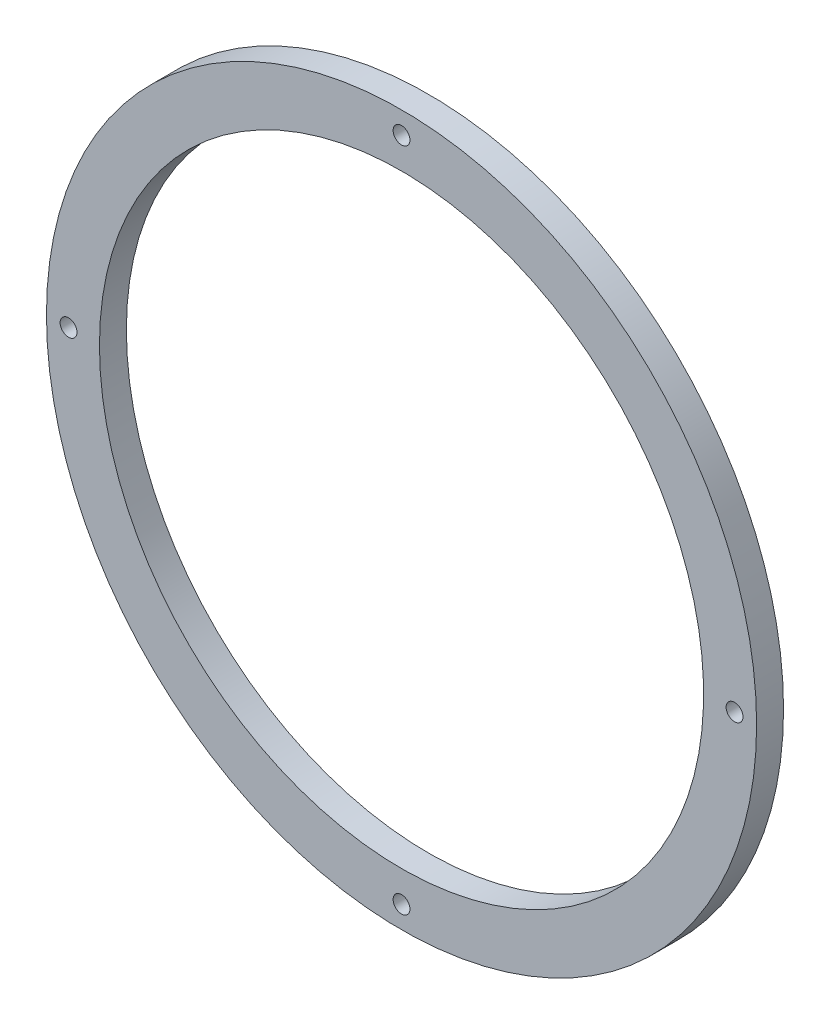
from build123d import *

# Parameters (mm, degrees)
SKETCH1_R           = 100.5
SKETCH1_R_2         = 85.5
SKETCH1_R_3         = 2.38125
BOSS_EXTRUDE1_DEPTH = 7.62


with BuildPart() as part:
    # Sketch1 → Boss-Extrude1 (new body)
    with BuildSketch(Plane.XY):
        with Locations(Location((0, 0, 0), (0, 0, 180))):
            Circle(SKETCH1_R)
        with Locations(Location((0, 0, 0), (0, 0, 180))):
            Circle(SKETCH1_R_2, mode=Mode.SUBTRACT)
        with Locations(Location((0, 94.25, 0), (0, 0, 180))):
            Circle(SKETCH1_R_3, mode=Mode.SUBTRACT)
        with Locations(Location((94.25, 0, 0), (0, 0, 180))):
            Circle(SKETCH1_R_3, mode=Mode.SUBTRACT)
        with Locations(Location((0, -94.25, 0), (0, 0, 180))):
            Circle(SKETCH1_R_3, mode=Mode.SUBTRACT)
        with Locations(Location((-94.25, 0, 0), (0, 0, 180))):
            Circle(SKETCH1_R_3, mode=Mode.SUBTRACT)
    extrude(amount=BOSS_EXTRUDE1_DEPTH)


solid = part.part
